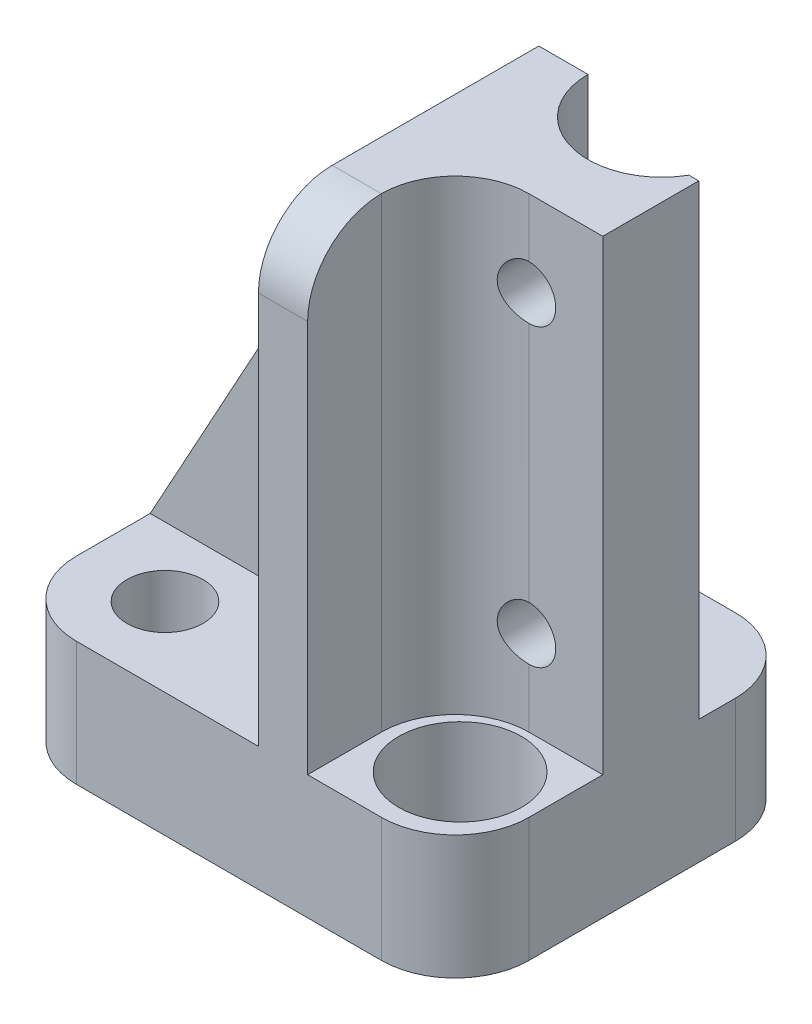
ISO-10303-21;
HEADER;
FILE_DESCRIPTION(('STEP AP214'),'2;1');
FILE_NAME('part.step','',(''),(''),'','','');
FILE_SCHEMA(('AUTOMOTIVE_DESIGN { 1 0 10303 214 1 1 1 1 }'));
ENDSEC;
DATA;
#1=APPLICATION_CONTEXT('core data for automotive mechanical design processes');
#2=APPLICATION_PROTOCOL_DEFINITION('international standard','automotive_design',2000,#1);
#3=PRODUCT_CONTEXT('',#1,'mechanical');
#4=PRODUCT('Part','Part','',(#3));
#5=PRODUCT_RELATED_PRODUCT_CATEGORY('part','',(#4));
#6=PRODUCT_DEFINITION_FORMATION('','',#4);
#7=PRODUCT_DEFINITION_CONTEXT('part definition',#1,'design');
#8=PRODUCT_DEFINITION('design','',#6,#7);
#9=PRODUCT_DEFINITION_SHAPE('','',#8);
#10=(LENGTH_UNIT() NAMED_UNIT(*) SI_UNIT(.MILLI.,.METRE.));
#11=(NAMED_UNIT(*) PLANE_ANGLE_UNIT() SI_UNIT($,.RADIAN.));
#12=(NAMED_UNIT(*) SI_UNIT($,.STERADIAN.) SOLID_ANGLE_UNIT());
#13=UNCERTAINTY_MEASURE_WITH_UNIT(LENGTH_MEASURE(1.E-05),#10,'distance_accuracy_value','');
#14=(GEOMETRIC_REPRESENTATION_CONTEXT(3) GLOBAL_UNCERTAINTY_ASSIGNED_CONTEXT((#13)) GLOBAL_UNIT_ASSIGNED_CONTEXT((#10,
#11,#12)) REPRESENTATION_CONTEXT('',''));
#15=CARTESIAN_POINT('',(0.,0.,0.));
#16=DIRECTION('',(0.,0.,1.));
#17=DIRECTION('',(1.,0.,0.));
#18=AXIS2_PLACEMENT_3D('',#15,#16,#17);
#19=CARTESIAN_POINT('',(4.7625,0.,19.685));
#20=DIRECTION('',(-1.,0.,0.));
#21=DIRECTION('',(0.,0.,1.));
#22=AXIS2_PLACEMENT_3D('',#19,#20,#21);
#23=PLANE('',#22);
#24=DIRECTION('',(0.,0.,-1.));
#25=VECTOR('',#24,1.);
#26=CARTESIAN_POINT('',(4.7625,8.001,19.685));
#27=LINE('',#26,#25);
#28=CARTESIAN_POINT('',(4.7625,8.001,13.335));
#29=VERTEX_POINT('',#28);
#30=CARTESIAN_POINT('',(4.7625,8.001,8.5725));
#31=VERTEX_POINT('',#30);
#32=EDGE_CURVE('E434',#29,#31,#27,.T.);
#33=ORIENTED_EDGE('',*,*,#32,.F.);
#34=DIRECTION('',(0.,1.,0.));
#35=VECTOR('',#34,1.);
#36=CARTESIAN_POINT('',(4.7625,0.,13.335));
#37=LINE('',#36,#35);
#38=CARTESIAN_POINT('',(4.7625,0.,13.335));
#39=VERTEX_POINT('',#38);
#40=EDGE_CURVE('E343',#29,#39,#37,.F.);
#41=ORIENTED_EDGE('',*,*,#40,.T.);
#42=DIRECTION('',(0.,0.,-1.));
#43=VECTOR('',#42,1.);
#44=CARTESIAN_POINT('',(4.7625,0.,19.685));
#45=LINE('',#44,#43);
#46=CARTESIAN_POINT('',(4.7625,0.,0.));
#47=VERTEX_POINT('',#46);
#48=EDGE_CURVE('E408',#39,#47,#45,.T.);
#49=ORIENTED_EDGE('',*,*,#48,.T.);
#50=DIRECTION('',(0.,1.,0.));
#51=VECTOR('',#50,1.);
#52=CARTESIAN_POINT('',(4.7625,0.,0.));
#53=LINE('',#52,#51);
#54=CARTESIAN_POINT('',(4.7625,8.001,0.));
#55=VERTEX_POINT('',#54);
#56=EDGE_CURVE('E455',#47,#55,#53,.T.);
#57=ORIENTED_EDGE('',*,*,#56,.T.);
#58=DIRECTION('',(0.,0.,-1.));
#59=VECTOR('',#58,1.);
#60=CARTESIAN_POINT('',(4.7625,8.001,-19.685));
#61=LINE('',#60,#59);
#62=CARTESIAN_POINT('',(4.7625,8.001,2.37595244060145));
#63=VERTEX_POINT('',#62);
#64=EDGE_CURVE('E475',#63,#55,#61,.T.);
#65=ORIENTED_EDGE('',*,*,#64,.F.);
#66=DIRECTION('',(0.,1.,0.));
#67=VECTOR('',#66,1.);
#68=CARTESIAN_POINT('',(4.7625,8.001,2.37595244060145));
#69=LINE('',#68,#67);
#70=CARTESIAN_POINT('',(4.7625,38.1,2.37595244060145));
#71=VERTEX_POINT('',#70);
#72=EDGE_CURVE('E491',#63,#71,#69,.T.);
#73=ORIENTED_EDGE('',*,*,#72,.T.);
#74=DIRECTION('',(0.,0.,-1.));
#75=VECTOR('',#74,1.);
#76=CARTESIAN_POINT('',(4.7625,38.1,19.685));
#77=LINE('',#76,#75);
#78=CARTESIAN_POINT('',(4.7625,38.1,8.5725));
#79=VERTEX_POINT('',#78);
#80=EDGE_CURVE('E379',#79,#71,#77,.T.);
#81=ORIENTED_EDGE('',*,*,#80,.F.);
#82=DIRECTION('',(0.,1.,0.));
#83=VECTOR('',#82,1.);
#84=CARTESIAN_POINT('',(4.7625,8.001,8.5725));
#85=LINE('',#84,#83);
#86=EDGE_CURVE('E447',#31,#79,#85,.T.);
#87=ORIENTED_EDGE('',*,*,#86,.F.);
#88=EDGE_LOOP('',(#33,#41,#49,#57,#65,#73,#81,#87));
#89=FACE_BOUND('',#88,.T.);
#90=ADVANCED_FACE('F37',(#89),#23,.F.);
#91=CARTESIAN_POINT('',(-24.4475,8.001,19.685));
#92=DIRECTION('',(1.,0.,0.));
#93=DIRECTION('',(0.,0.,-1.));
#94=AXIS2_PLACEMENT_3D('',#91,#92,#93);
#95=PLANE('',#94);
#96=DIRECTION('',(0.,0.,-1.));
#97=VECTOR('',#96,1.);
#98=CARTESIAN_POINT('',(-24.4475,0.,19.685));
#99=LINE('',#98,#97);
#100=CARTESIAN_POINT('',(-24.4475,0.,13.335));
#101=VERTEX_POINT('',#100);
#102=CARTESIAN_POINT('',(-24.4475,0.,6.03250000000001));
#103=VERTEX_POINT('',#102);
#104=EDGE_CURVE('E410',#101,#103,#99,.T.);
#105=ORIENTED_EDGE('',*,*,#104,.F.);
#106=DIRECTION('',(0.,1.,0.));
#107=VECTOR('',#106,1.);
#108=CARTESIAN_POINT('',(-24.4475,8.001,13.335));
#109=LINE('',#108,#107);
#110=CARTESIAN_POINT('',(-24.4475,8.001,13.335));
#111=VERTEX_POINT('',#110);
#112=EDGE_CURVE('E335',#101,#111,#109,.T.);
#113=ORIENTED_EDGE('',*,*,#112,.T.);
#114=DIRECTION('',(0.,0.,-1.));
#115=VECTOR('',#114,1.);
#116=CARTESIAN_POINT('',(-24.4475,8.001,19.685));
#117=LINE('',#116,#115);
#118=CARTESIAN_POINT('',(-24.4475,8.001,8.5725));
#119=VERTEX_POINT('',#118);
#120=EDGE_CURVE('E380',#111,#119,#117,.T.);
#121=ORIENTED_EDGE('',*,*,#120,.T.);
#122=CARTESIAN_POINT('',(-24.4475,8.001,6.03250000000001));
#123=VERTEX_POINT('',#122);
#124=EDGE_CURVE('E398',#119,#123,#117,.T.);
#125=ORIENTED_EDGE('',*,*,#124,.T.);
#126=DIRECTION('',(0.,1.,0.));
#127=VECTOR('',#126,1.);
#128=CARTESIAN_POINT('',(-24.4475,0.,6.03250000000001));
#129=LINE('',#128,#127);
#130=EDGE_CURVE('E461',#103,#123,#129,.T.);
#131=ORIENTED_EDGE('',*,*,#130,.F.);
#132=EDGE_LOOP('',(#105,#113,#121,#125,#131));
#133=FACE_BOUND('',#132,.T.);
#134=ADVANCED_FACE('F302',(#133),#95,.F.);
#135=CARTESIAN_POINT('',(-24.4475,0.,19.685));
#136=DIRECTION('',(0.,1.,0.));
#137=DIRECTION('',(0.,0.,1.));
#138=AXIS2_PLACEMENT_3D('',#135,#136,#137);
#139=PLANE('',#138);
#140=CARTESIAN_POINT('',(-19.05,0.,13.0175));
#141=DIRECTION('',(0.,1.,0.));
#142=DIRECTION('',(0.,0.,1.));
#143=AXIS2_PLACEMENT_3D('',#140,#141,#142);
#144=CIRCLE('',#143,2.45745);
#145=CARTESIAN_POINT('',(-19.05,0.,15.47495));
#146=VERTEX_POINT('',#145);
#147=EDGE_CURVE('E537',#146,#146,#144,.T.);
#148=ORIENTED_EDGE('',*,*,#147,.T.);
#149=EDGE_LOOP('',(#148));
#150=FACE_BOUND('',#149,.T.);
#151=CARTESIAN_POINT('',(0.,0.,13.0175));
#152=DIRECTION('',(0.,1.,0.));
#153=DIRECTION('',(0.,0.,1.));
#154=AXIS2_PLACEMENT_3D('',#151,#152,#153);
#155=CIRCLE('',#154,2.45745);
#156=CARTESIAN_POINT('',(0.,0.,15.47495));
#157=VERTEX_POINT('',#156);
#158=EDGE_CURVE('E534',#157,#157,#155,.T.);
#159=ORIENTED_EDGE('',*,*,#158,.T.);
#160=EDGE_LOOP('',(#159));
#161=FACE_BOUND('',#160,.T.);
#162=ORIENTED_EDGE('',*,*,#48,.F.);
#163=CARTESIAN_POINT('',(0.,0.,13.335));
#164=DIRECTION('',(0.,1.,0.));
#165=DIRECTION('',(0.,0.,1.));
#166=AXIS2_PLACEMENT_3D('',#163,#164,#165);
#167=CIRCLE('',#166,4.7625);
#168=CARTESIAN_POINT('',(0.,0.,18.0975));
#169=VERTEX_POINT('',#168);
#170=EDGE_CURVE('E339',#39,#169,#167,.F.);
#171=ORIENTED_EDGE('',*,*,#170,.T.);
#172=DIRECTION('',(-1.,0.,0.));
#173=VECTOR('',#172,1.);
#174=CARTESIAN_POINT('',(-24.4475,0.,18.0975));
#175=LINE('',#174,#173);
#176=CARTESIAN_POINT('',(-19.685,0.,18.0975));
#177=VERTEX_POINT('',#176);
#178=EDGE_CURVE('E443',#169,#177,#175,.T.);
#179=ORIENTED_EDGE('',*,*,#178,.T.);
#180=CARTESIAN_POINT('',(-19.685,0.,13.335));
#181=DIRECTION('',(0.,1.,0.));
#182=DIRECTION('',(0.,0.,1.));
#183=AXIS2_PLACEMENT_3D('',#180,#181,#182);
#184=CIRCLE('',#183,4.7625);
#185=EDGE_CURVE('E332',#177,#101,#184,.F.);
#186=ORIENTED_EDGE('',*,*,#185,.T.);
#187=ORIENTED_EDGE('',*,*,#104,.T.);
#188=DIRECTION('',(1.,0.,0.));
#189=VECTOR('',#188,1.);
#190=CARTESIAN_POINT('',(-7.9375,0.,6.0325));
#191=LINE('',#190,#189);
#192=CARTESIAN_POINT('',(-12.7,0.,6.0325));
#193=VERTEX_POINT('',#192);
#194=EDGE_CURVE('E522',#103,#193,#191,.T.);
#195=ORIENTED_EDGE('',*,*,#194,.T.);
#196=CARTESIAN_POINT('',(-12.7,0.,1.27));
#197=DIRECTION('',(0.,1.,0.));
#198=DIRECTION('',(0.,0.,1.));
#199=AXIS2_PLACEMENT_3D('',#196,#197,#198);
#200=CIRCLE('',#199,4.7625);
#201=CARTESIAN_POINT('',(-7.9375,0.,1.27));
#202=VERTEX_POINT('',#201);
#203=EDGE_CURVE('E207',#193,#202,#200,.T.);
#204=ORIENTED_EDGE('',*,*,#203,.T.);
#205=DIRECTION('',(0.,0.,-1.));
#206=VECTOR('',#205,1.);
#207=CARTESIAN_POINT('',(-7.9375,0.,-4.7625));
#208=LINE('',#207,#206);
#209=CARTESIAN_POINT('',(-7.9375,0.,0.));
#210=VERTEX_POINT('',#209);
#211=EDGE_CURVE('E517',#202,#210,#208,.T.);
#212=ORIENTED_EDGE('',*,*,#211,.T.);
#213=CARTESIAN_POINT('',(-3.175,0.,0.));
#214=DIRECTION('',(0.,1.,0.));
#215=DIRECTION('',(0.,0.,1.));
#216=AXIS2_PLACEMENT_3D('',#213,#214,#215);
#217=CIRCLE('',#216,4.7625);
#218=CARTESIAN_POINT('',(-3.175,0.,-4.7625));
#219=VERTEX_POINT('',#218);
#220=EDGE_CURVE('E340',#210,#219,#217,.F.);
#221=ORIENTED_EDGE('',*,*,#220,.T.);
#222=DIRECTION('',(1.,0.,0.));
#223=VECTOR('',#222,1.);
#224=CARTESIAN_POINT('',(0.,0.,-4.7625));
#225=LINE('',#224,#223);
#226=CARTESIAN_POINT('',(0.,0.,-4.7625));
#227=VERTEX_POINT('',#226);
#228=EDGE_CURVE('E521',#219,#227,#225,.T.);
#229=ORIENTED_EDGE('',*,*,#228,.T.);
#230=CARTESIAN_POINT('',(0.,0.,0.));
#231=DIRECTION('',(0.,-1.,0.));
#232=DIRECTION('',(0.,0.,1.));
#233=AXIS2_PLACEMENT_3D('',#230,#231,#232);
#234=CIRCLE('',#233,4.7625);
#235=EDGE_CURVE('E439',#227,#47,#234,.T.);
#236=ORIENTED_EDGE('',*,*,#235,.T.);
#237=EDGE_LOOP('',(#162,#171,#179,#186,#187,#195,#204,#212,#221,#229,#236));
#238=FACE_BOUND('',#237,.T.);
#239=ADVANCED_FACE('F308',(#150,#161,#238),#139,.F.);
#240=CARTESIAN_POINT('',(4.7625,38.1,19.685));
#241=DIRECTION('',(0.,-1.,0.));
#242=DIRECTION('',(0.,0.,-1.));
#243=AXIS2_PLACEMENT_3D('',#240,#241,#242);
#244=PLANE('',#243);
#245=DIRECTION('',(0.,0.,-1.));
#246=VECTOR('',#245,1.);
#247=CARTESIAN_POINT('',(-7.9375,38.1,19.685));
#248=LINE('',#247,#246);
#249=CARTESIAN_POINT('',(-7.9375,38.1,13.335));
#250=VERTEX_POINT('',#249);
#251=CARTESIAN_POINT('',(-7.9375,38.1,1.27));
#252=VERTEX_POINT('',#251);
#253=EDGE_CURVE('E374',#250,#252,#248,.T.);
#254=ORIENTED_EDGE('',*,*,#253,.F.);
#255=DIRECTION('',(-1.,0.,0.));
#256=VECTOR('',#255,1.);
#257=CARTESIAN_POINT('',(4.7625,38.1,13.335));
#258=LINE('',#257,#256);
#259=CARTESIAN_POINT('',(-4.7625,38.1,13.335));
#260=VERTEX_POINT('',#259);
#261=EDGE_CURVE('E45',#250,#260,#258,.F.);
#262=ORIENTED_EDGE('',*,*,#261,.T.);
#263=CARTESIAN_POINT('',(0.,38.1,13.335));
#264=DIRECTION('',(0.,-1.,0.));
#265=DIRECTION('',(0.,0.,-1.));
#266=AXIS2_PLACEMENT_3D('',#263,#264,#265);
#267=CIRCLE('',#266,4.7625);
#268=CARTESIAN_POINT('',(0.,38.1,8.5725));
#269=VERTEX_POINT('',#268);
#270=EDGE_CURVE('E244',#260,#269,#267,.T.);
#271=ORIENTED_EDGE('',*,*,#270,.T.);
#272=DIRECTION('',(-1.,0.,0.));
#273=VECTOR('',#272,1.);
#274=CARTESIAN_POINT('',(4.7625,38.1,8.5725));
#275=LINE('',#274,#273);
#276=EDGE_CURVE('E454',#79,#269,#275,.T.);
#277=ORIENTED_EDGE('',*,*,#276,.F.);
#278=ORIENTED_EDGE('',*,*,#80,.T.);
#279=DIRECTION('',(1.,0.,0.));
#280=VECTOR('',#279,1.);
#281=CARTESIAN_POINT('',(4.7625,38.1,2.37595244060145));
#282=LINE('',#281,#280);
#283=CARTESIAN_POINT('',(4.1275,38.1,2.37595244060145));
#284=VERTEX_POINT('',#283);
#285=EDGE_CURVE('E483',#284,#71,#282,.T.);
#286=ORIENTED_EDGE('',*,*,#285,.F.);
#287=CARTESIAN_POINT('',(0.,38.1,0.));
#288=DIRECTION('',(0.,1.,0.));
#289=DIRECTION('',(0.,0.,1.));
#290=AXIS2_PLACEMENT_3D('',#287,#288,#289);
#291=CIRCLE('',#290,4.7625);
#292=CARTESIAN_POINT('',(-4.7625,38.1,0.));
#293=VERTEX_POINT('',#292);
#294=EDGE_CURVE('E450',#293,#284,#291,.T.);
#295=ORIENTED_EDGE('',*,*,#294,.F.);
#296=DIRECTION('',(1.,0.,0.));
#297=VECTOR('',#296,1.);
#298=CARTESIAN_POINT('',(-4.7625,38.1,0.));
#299=LINE('',#298,#297);
#300=CARTESIAN_POINT('',(-7.9375,38.1,0.));
#301=VERTEX_POINT('',#300);
#302=EDGE_CURVE('E472',#301,#293,#299,.T.);
#303=ORIENTED_EDGE('',*,*,#302,.F.);
#304=DIRECTION('',(0.,0.,-1.));
#305=VECTOR('',#304,1.);
#306=CARTESIAN_POINT('',(-7.9375,38.1,-4.7625));
#307=LINE('',#306,#305);
#308=EDGE_CURVE('E376',#252,#301,#307,.T.);
#309=ORIENTED_EDGE('',*,*,#308,.F.);
#310=EDGE_LOOP('',(#254,#262,#271,#277,#278,#286,#295,#303,#309));
#311=FACE_BOUND('',#310,.T.);
#312=ADVANCED_FACE('F314',(#311),#244,.F.);
#313=CARTESIAN_POINT('',(-24.4475,8.001,19.685));
#314=DIRECTION('',(0.876762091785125,-0.480924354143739,0.));
#315=DIRECTION('',(0.480924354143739,0.876762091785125,0.));
#316=AXIS2_PLACEMENT_3D('',#313,#314,#315);
#317=PLANE('',#316);
#318=ORIENTED_EDGE('',*,*,#253,.T.);
#319=CARTESIAN_POINT('',(-12.7,29.4175961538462,1.27));
#320=DIRECTION('',(0.876762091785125,-0.480924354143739,0.));
#321=DIRECTION('',(-0.480924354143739,-0.876762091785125,0.));
#322=AXIS2_PLACEMENT_3D('',#319,#320,#321);
#323=ELLIPSE('',#322,9.90280479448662,4.7625);
#324=CARTESIAN_POINT('',(-12.7,29.4175961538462,6.0325));
#325=VERTEX_POINT('',#324);
#326=EDGE_CURVE('E246',#252,#325,#323,.T.);
#327=ORIENTED_EDGE('',*,*,#326,.T.);
#328=DIRECTION('',(-0.480924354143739,-0.876762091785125,0.));
#329=VECTOR('',#328,1.);
#330=CARTESIAN_POINT('',(-24.4475,8.001,6.03250000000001));
#331=LINE('',#330,#329);
#332=EDGE_CURVE('E417',#325,#123,#331,.T.);
#333=ORIENTED_EDGE('',*,*,#332,.T.);
#334=ORIENTED_EDGE('',*,*,#124,.F.);
#335=DIRECTION('',(0.480924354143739,0.876762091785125,0.));
#336=VECTOR('',#335,1.);
#337=CARTESIAN_POINT('',(-24.4475,8.001,8.5725));
#338=LINE('',#337,#336);
#339=CARTESIAN_POINT('',(-12.7,29.4175961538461,8.5725));
#340=VERTEX_POINT('',#339);
#341=EDGE_CURVE('E386',#119,#340,#338,.T.);
#342=ORIENTED_EDGE('',*,*,#341,.T.);
#343=CARTESIAN_POINT('',(-12.7,29.4175961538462,13.335));
#344=DIRECTION('',(0.876762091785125,-0.480924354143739,0.));
#345=DIRECTION('',(-0.480924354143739,-0.876762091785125,0.));
#346=AXIS2_PLACEMENT_3D('',#343,#344,#345);
#347=ELLIPSE('',#346,9.90280479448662,4.7625);
#348=EDGE_CURVE('E241',#340,#250,#347,.T.);
#349=ORIENTED_EDGE('',*,*,#348,.T.);
#350=EDGE_LOOP('',(#318,#327,#333,#334,#342,#349));
#351=FACE_BOUND('',#350,.T.);
#352=ADVANCED_FACE('F383',(#351),#317,.F.);
#353=CARTESIAN_POINT('',(0.,8.001,0.));
#354=DIRECTION('',(0.,1.,0.));
#355=DIRECTION('',(0.,0.,1.));
#356=AXIS2_PLACEMENT_3D('',#353,#354,#355);
#357=CYLINDRICAL_SURFACE('',#356,4.7625);
#358=CARTESIAN_POINT('',(1.7272,32.5755,4.43826389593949));
#359=CARTESIAN_POINT('',(1.7272024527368,32.6690250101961,4.43826170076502));
#360=CARTESIAN_POINT('',(1.71957825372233,32.7625332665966,4.44125227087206));
#361=CARTESIAN_POINT('',(1.68941050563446,32.9467453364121,4.45281432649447));
#362=CARTESIAN_POINT('',(1.66686659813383,33.0374490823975,4.46138594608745));
#363=CARTESIAN_POINT('',(1.60778321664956,33.2133454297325,4.48301418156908));
#364=CARTESIAN_POINT('',(1.57127535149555,33.2985499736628,4.49606066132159));
#365=CARTESIAN_POINT('',(1.48541126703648,33.4616567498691,4.5251527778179));
#366=CARTESIAN_POINT('',(1.43605147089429,33.5395569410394,4.54119924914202));
#367=CARTESIAN_POINT('',(1.32342999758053,33.6894604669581,4.57531830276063));
#368=CARTESIAN_POINT('',(1.25966957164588,33.7610762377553,4.59344781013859));
#369=CARTESIAN_POINT('',(1.12111687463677,33.8928690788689,4.6292134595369));
#370=CARTESIAN_POINT('',(1.04632244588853,33.9530439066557,4.64684950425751));
#371=CARTESIAN_POINT('',(0.884916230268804,34.0620799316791,4.68031233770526));
#372=CARTESIAN_POINT('',(0.798006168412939,34.1105245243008,4.6960645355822));
#373=CARTESIAN_POINT('',(0.616598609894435,34.1919469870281,4.723304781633));
#374=CARTESIAN_POINT('',(0.522103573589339,34.2249298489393,4.73479420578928));
#375=CARTESIAN_POINT('',(0.332279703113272,34.2731472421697,4.75181055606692));
#376=CARTESIAN_POINT('',(0.237140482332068,34.289047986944,4.75756062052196));
#377=CARTESIAN_POINT('',(0.0453819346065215,34.3047794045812,4.7632484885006));
#378=CARTESIAN_POINT('',(-0.0512369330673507,34.3046149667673,4.76318806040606));
#379=CARTESIAN_POINT('',(-0.238455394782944,34.288619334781,4.75740656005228));
#380=CARTESIAN_POINT('',(-0.32912650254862,34.2735141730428,4.7519478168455));
#381=CARTESIAN_POINT('',(-0.506546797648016,34.2292807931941,4.73632258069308));
#382=CARTESIAN_POINT('',(-0.59329570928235,34.2001515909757,4.72615575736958));
#383=CARTESIAN_POINT('',(-0.761867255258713,34.1283339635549,4.70194903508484));
#384=CARTESIAN_POINT('',(-0.843602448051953,34.0854588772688,4.68785619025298));
#385=CARTESIAN_POINT('',(-0.998915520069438,33.9875279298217,4.65723624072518));
#386=CARTESIAN_POINT('',(-1.07249085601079,33.9324682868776,4.64070838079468));
#387=CARTESIAN_POINT('',(-1.2136878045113,33.8081826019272,4.60586004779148));
#388=CARTESIAN_POINT('',(-1.28075862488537,33.7383435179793,4.58749097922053));
#389=CARTESIAN_POINT('',(-1.40243506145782,33.5882830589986,4.55177029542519));
#390=CARTESIAN_POINT('',(-1.45703795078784,33.5080594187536,4.53441890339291));
#391=CARTESIAN_POINT('',(-1.55318831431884,33.3374672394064,4.50240377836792));
#392=CARTESIAN_POINT('',(-1.59445924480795,33.2469308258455,4.48779931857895));
#393=CARTESIAN_POINT('',(-1.66096705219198,33.0595253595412,4.46361535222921));
#394=CARTESIAN_POINT('',(-1.68621216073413,32.9626595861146,4.45403326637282));
#395=CARTESIAN_POINT('',(-1.71873956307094,32.7707579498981,4.44157966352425));
#396=CARTESIAN_POINT('',(-1.72689070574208,32.675890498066,4.43838397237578));
#397=CARTESIAN_POINT('',(-1.72749177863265,32.4861101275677,4.43815063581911));
#398=CARTESIAN_POINT('',(-1.71994527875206,32.3911972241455,4.44111159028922));
#399=CARTESIAN_POINT('',(-1.69015114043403,32.208315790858,4.45253046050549));
#400=CARTESIAN_POINT('',(-1.66855346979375,32.1202244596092,4.46074508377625));
#401=CARTESIAN_POINT('',(-1.61207609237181,31.9489488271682,4.48146351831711));
#402=CARTESIAN_POINT('',(-1.5771937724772,31.8657654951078,4.49396817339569));
#403=CARTESIAN_POINT('',(-1.49372582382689,31.7033550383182,4.52241023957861));
#404=CARTESIAN_POINT('',(-1.44469384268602,31.6243765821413,4.53845462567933));
#405=CARTESIAN_POINT('',(-1.33480249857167,31.4754580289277,4.57198033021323));
#406=CARTESIAN_POINT('',(-1.2739390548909,31.4055210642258,4.58946214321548));
#407=CARTESIAN_POINT('',(-1.13788812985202,31.2724245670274,4.62513115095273));
#408=CARTESIAN_POINT('',(-1.06207032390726,31.2099022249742,4.6432996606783));
#409=CARTESIAN_POINT('',(-0.900571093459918,31.0984022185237,4.6773045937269));
#410=CARTESIAN_POINT('',(-0.814889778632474,31.0494244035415,4.69314104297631));
#411=CARTESIAN_POINT('',(-0.636285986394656,30.9667759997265,4.72066340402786));
#412=CARTESIAN_POINT('',(-0.543399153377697,30.9330350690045,4.73236833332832));
#413=CARTESIAN_POINT('',(-0.35275097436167,30.881830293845,4.75038126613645));
#414=CARTESIAN_POINT('',(-0.254991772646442,30.8643593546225,4.75669162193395));
#415=CARTESIAN_POINT('',(-0.0631529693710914,30.8469179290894,4.76299521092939));
#416=CARTESIAN_POINT('',(0.0308341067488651,30.8460395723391,4.76331614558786));
#417=CARTESIAN_POINT('',(0.217556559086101,30.8595023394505,4.75844456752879));
#418=CARTESIAN_POINT('',(0.310292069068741,30.8738418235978,4.7532526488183));
#419=CARTESIAN_POINT('',(0.489853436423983,30.9167042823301,4.73808000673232));
#420=CARTESIAN_POINT('',(0.576763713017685,30.9449139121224,4.72820524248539));
#421=CARTESIAN_POINT('',(0.744633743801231,31.0144112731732,4.70469111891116));
#422=CARTESIAN_POINT('',(0.825592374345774,31.0557014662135,4.69105105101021));
#423=CARTESIAN_POINT('',(0.982864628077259,31.1521070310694,4.66069310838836));
#424=CARTESIAN_POINT('',(1.05885511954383,31.2077166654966,4.64387256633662));
#425=CARTESIAN_POINT('',(1.20071184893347,31.3303852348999,4.6092340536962));
#426=CARTESIAN_POINT('',(1.26657456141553,31.3974481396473,4.59141573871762));
#427=CARTESIAN_POINT('',(1.38958521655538,31.5449969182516,4.55573955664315));
#428=CARTESIAN_POINT('',(1.44615494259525,31.6259763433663,4.53792175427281));
#429=CARTESIAN_POINT('',(1.5448849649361,31.7968571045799,4.50526934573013));
#430=CARTESIAN_POINT('',(1.58704550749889,31.8867582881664,4.4904346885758));
#431=CARTESIAN_POINT('',(1.65604477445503,32.0746001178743,4.46545673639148));
#432=CARTESIAN_POINT('',(1.68262483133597,32.1726472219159,4.45539314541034));
#433=CARTESIAN_POINT('',(1.7181963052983,32.3723041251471,4.44179970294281));
#434=CARTESIAN_POINT('',(1.72719733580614,32.4739119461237,4.43826628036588));
#435=CARTESIAN_POINT('',(1.7272,32.5755,4.43826389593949));
#436=B_SPLINE_CURVE_WITH_KNOTS('',3,(#358,#359,#360,#361,#362,#363,#364,#365,#366,#367,#368,
#369,#370,#371,#372,#373,#374,#375,#376,#377,#378,#379,#380,#381,#382,#383,#384,#385,#386,#387,
#388,#389,#390,#391,#392,#393,#394,#395,#396,#397,#398,#399,#400,#401,#402,#403,#404,#405,#406,
#407,#408,#409,#410,#411,#412,#413,#414,#415,#416,#417,#418,#419,#420,#421,#422,#423,#424,#425,
#426,#427,#428,#429,#430,#431,#432,#433,#434,#435),.UNSPECIFIED.,.T.,.F.,(4,2,2,2,2,2,2,2,2,2,2,
2,2,2,2,2,2,2,2,2,2,2,2,2,2,2,2,2,2,2,2,2,2,2,2,2,2,2,4),(0.,0.280197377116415,
0.560401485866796,0.839975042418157,1.11962649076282,1.41107897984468,1.7025885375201,
2.00329061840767,2.30389555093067,2.59229594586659,2.88060856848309,3.15556663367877,
3.43054399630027,3.70942590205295,3.98839448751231,4.28272167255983,4.57711316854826,
4.87726856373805,5.17726965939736,5.46161111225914,5.74588790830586,6.01786922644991,
6.28990407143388,6.57168943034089,6.85357215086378,7.15197079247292,7.4503661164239,
7.74736943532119,8.04424318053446,8.32482325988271,8.60537310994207,8.87985756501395,
9.15439370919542,9.44010280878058,9.72591113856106,10.0255929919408,10.3252697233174,
10.6297902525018,10.9341442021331),.UNSPECIFIED.);
#437=CARTESIAN_POINT('',(1.7272,32.5755,4.43826389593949));
#438=VERTEX_POINT('',#437);
#439=EDGE_CURVE('E216',#438,#438,#436,.T.);
#440=ORIENTED_EDGE('',*,*,#439,.T.);
#441=EDGE_LOOP('',(#440));
#442=FACE_BOUND('',#441,.T.);
#443=CARTESIAN_POINT('',(1.7272,13.5255,4.43826389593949));
#444=CARTESIAN_POINT('',(1.7272024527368,13.6190250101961,4.43826170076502));
#445=CARTESIAN_POINT('',(1.71957825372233,13.7125332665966,4.44125227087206));
#446=CARTESIAN_POINT('',(1.68941050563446,13.8967453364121,4.45281432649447));
#447=CARTESIAN_POINT('',(1.66686659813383,13.9874490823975,4.46138594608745));
#448=CARTESIAN_POINT('',(1.60778321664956,14.1633454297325,4.48301418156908));
#449=CARTESIAN_POINT('',(1.57127535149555,14.2485499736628,4.49606066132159));
#450=CARTESIAN_POINT('',(1.48541126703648,14.4116567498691,4.5251527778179));
#451=CARTESIAN_POINT('',(1.43605147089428,14.4895569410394,4.54119924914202));
#452=CARTESIAN_POINT('',(1.32342999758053,14.6394604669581,4.57531830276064));
#453=CARTESIAN_POINT('',(1.25966957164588,14.7110762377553,4.59344781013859));
#454=CARTESIAN_POINT('',(1.12111687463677,14.8428690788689,4.6292134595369));
#455=CARTESIAN_POINT('',(1.04632244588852,14.9030439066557,4.64684950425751));
#456=CARTESIAN_POINT('',(0.884916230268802,15.0120799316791,4.68031233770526));
#457=CARTESIAN_POINT('',(0.798006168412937,15.0605245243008,4.6960645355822));
#458=CARTESIAN_POINT('',(0.616598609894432,15.1419469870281,4.723304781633));
#459=CARTESIAN_POINT('',(0.522103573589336,15.1749298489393,4.73479420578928));
#460=CARTESIAN_POINT('',(0.332279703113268,15.2231472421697,4.75181055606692));
#461=CARTESIAN_POINT('',(0.237140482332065,15.239047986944,4.75756062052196));
#462=CARTESIAN_POINT('',(0.0453819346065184,15.2547794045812,4.7632484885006));
#463=CARTESIAN_POINT('',(-0.0512369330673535,15.2546149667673,4.76318806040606));
#464=CARTESIAN_POINT('',(-0.238455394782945,15.238619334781,4.75740656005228));
#465=CARTESIAN_POINT('',(-0.329126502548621,15.2235141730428,4.7519478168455));
#466=CARTESIAN_POINT('',(-0.506546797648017,15.1792807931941,4.73632258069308));
#467=CARTESIAN_POINT('',(-0.593295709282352,15.1501515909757,4.72615575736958));
#468=CARTESIAN_POINT('',(-0.761867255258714,15.0783339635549,4.70194903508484));
#469=CARTESIAN_POINT('',(-0.843602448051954,15.0354588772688,4.68785619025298));
#470=CARTESIAN_POINT('',(-0.998915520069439,14.9375279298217,4.65723624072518));
#471=CARTESIAN_POINT('',(-1.07249085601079,14.8824682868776,4.64070838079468));
#472=CARTESIAN_POINT('',(-1.2136878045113,14.7581826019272,4.60586004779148));
#473=CARTESIAN_POINT('',(-1.28075862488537,14.6883435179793,4.58749097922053));
#474=CARTESIAN_POINT('',(-1.40243506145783,14.5382830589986,4.55177029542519));
#475=CARTESIAN_POINT('',(-1.45703795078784,14.4580594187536,4.53441890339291));
#476=CARTESIAN_POINT('',(-1.55318831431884,14.2874672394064,4.50240377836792));
#477=CARTESIAN_POINT('',(-1.59445924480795,14.1969308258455,4.48779931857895));
#478=CARTESIAN_POINT('',(-1.66096705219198,14.0095253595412,4.46361535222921));
#479=CARTESIAN_POINT('',(-1.68621216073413,13.9126595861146,4.45403326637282));
#480=CARTESIAN_POINT('',(-1.71873956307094,13.7207579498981,4.44157966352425));
#481=CARTESIAN_POINT('',(-1.72689070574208,13.625890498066,4.43838397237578));
#482=CARTESIAN_POINT('',(-1.72749177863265,13.4361101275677,4.43815063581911));
#483=CARTESIAN_POINT('',(-1.71994527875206,13.3411972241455,4.44111159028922));
#484=CARTESIAN_POINT('',(-1.69015114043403,13.1583157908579,4.45253046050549));
#485=CARTESIAN_POINT('',(-1.66855346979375,13.0702244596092,4.46074508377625));
#486=CARTESIAN_POINT('',(-1.61207609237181,12.8989488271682,4.48146351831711));
#487=CARTESIAN_POINT('',(-1.5771937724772,12.8157654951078,4.49396817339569));
#488=CARTESIAN_POINT('',(-1.49372582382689,12.6533550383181,4.52241023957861));
#489=CARTESIAN_POINT('',(-1.44469384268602,12.5743765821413,4.53845462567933));
#490=CARTESIAN_POINT('',(-1.33480249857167,12.4254580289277,4.57198033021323));
#491=CARTESIAN_POINT('',(-1.2739390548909,12.3555210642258,4.58946214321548));
#492=CARTESIAN_POINT('',(-1.13788812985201,12.2224245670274,4.62513115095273));
#493=CARTESIAN_POINT('',(-1.06207032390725,12.1599022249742,4.6432996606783));
#494=CARTESIAN_POINT('',(-0.900571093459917,12.0484022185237,4.6773045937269));
#495=CARTESIAN_POINT('',(-0.814889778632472,11.9994244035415,4.69314104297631));
#496=CARTESIAN_POINT('',(-0.636285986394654,11.9167759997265,4.72066340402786));
#497=CARTESIAN_POINT('',(-0.543399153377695,11.8830350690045,4.73236833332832));
#498=CARTESIAN_POINT('',(-0.352750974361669,11.831830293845,4.75038126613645));
#499=CARTESIAN_POINT('',(-0.254991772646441,11.8143593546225,4.75669162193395));
#500=CARTESIAN_POINT('',(-0.0631529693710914,11.7969179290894,4.76299521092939));
#501=CARTESIAN_POINT('',(0.0308341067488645,11.7960395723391,4.76331614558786));
#502=CARTESIAN_POINT('',(0.217556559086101,11.8095023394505,4.75844456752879));
#503=CARTESIAN_POINT('',(0.310292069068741,11.8238418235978,4.7532526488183));
#504=CARTESIAN_POINT('',(0.489853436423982,11.8667042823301,4.73808000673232));
#505=CARTESIAN_POINT('',(0.576763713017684,11.8949139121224,4.72820524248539));
#506=CARTESIAN_POINT('',(0.74463374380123,11.9644112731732,4.70469111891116));
#507=CARTESIAN_POINT('',(0.825592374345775,12.0057014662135,4.69105105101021));
#508=CARTESIAN_POINT('',(0.982864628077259,12.1021070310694,4.66069310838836));
#509=CARTESIAN_POINT('',(1.05885511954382,12.1577166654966,4.64387256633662));
#510=CARTESIAN_POINT('',(1.20071184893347,12.2803852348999,4.6092340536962));
#511=CARTESIAN_POINT('',(1.26657456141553,12.3474481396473,4.59141573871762));
#512=CARTESIAN_POINT('',(1.38958521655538,12.4949969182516,4.55573955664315));
#513=CARTESIAN_POINT('',(1.44615494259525,12.5759763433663,4.53792175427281));
#514=CARTESIAN_POINT('',(1.5448849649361,12.7468571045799,4.50526934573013));
#515=CARTESIAN_POINT('',(1.58704550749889,12.8367582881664,4.4904346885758));
#516=CARTESIAN_POINT('',(1.65604477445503,13.0246001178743,4.46545673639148));
#517=CARTESIAN_POINT('',(1.68262483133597,13.1226472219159,4.45539314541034));
#518=CARTESIAN_POINT('',(1.7181963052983,13.3223041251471,4.44179970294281));
#519=CARTESIAN_POINT('',(1.72719733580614,13.4239119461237,4.43826628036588));
#520=CARTESIAN_POINT('',(1.7272,13.5255,4.43826389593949));
#521=B_SPLINE_CURVE_WITH_KNOTS('',3,(#443,#444,#445,#446,#447,#448,#449,#450,#451,#452,#453,
#454,#455,#456,#457,#458,#459,#460,#461,#462,#463,#464,#465,#466,#467,#468,#469,#470,#471,#472,
#473,#474,#475,#476,#477,#478,#479,#480,#481,#482,#483,#484,#485,#486,#487,#488,#489,#490,#491,
#492,#493,#494,#495,#496,#497,#498,#499,#500,#501,#502,#503,#504,#505,#506,#507,#508,#509,#510,
#511,#512,#513,#514,#515,#516,#517,#518,#519,#520),.UNSPECIFIED.,.T.,.F.,(4,2,2,2,2,2,2,2,2,2,2,
2,2,2,2,2,2,2,2,2,2,2,2,2,2,2,2,2,2,2,2,2,2,2,2,2,2,2,4),(0.,0.280197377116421,
0.560401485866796,0.839975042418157,1.11962649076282,1.41107897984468,1.7025885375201,
2.00329061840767,2.30389555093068,2.59229594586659,2.88060856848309,3.15556663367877,
3.43054399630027,3.70942590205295,3.98839448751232,4.28272167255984,4.57711316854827,
4.87726856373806,5.17726965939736,5.46161111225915,5.74588790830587,6.01786922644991,
6.28990407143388,6.57168943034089,6.85357215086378,7.15197079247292,7.4503661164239,
7.74736943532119,8.04424318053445,8.32482325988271,8.60537310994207,8.87985756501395,
9.15439370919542,9.44010280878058,9.72591113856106,10.0255929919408,10.3252697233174,
10.6297902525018,10.9341442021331),.UNSPECIFIED.);
#522=CARTESIAN_POINT('',(1.7272,13.5255,4.43826389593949));
#523=VERTEX_POINT('',#522);
#524=EDGE_CURVE('E249',#523,#523,#521,.T.);
#525=ORIENTED_EDGE('',*,*,#524,.T.);
#526=EDGE_LOOP('',(#525));
#527=FACE_BOUND('',#526,.T.);
#528=ORIENTED_EDGE('',*,*,#294,.T.);
#529=DIRECTION('',(0.,1.,0.));
#530=VECTOR('',#529,1.);
#531=CARTESIAN_POINT('',(4.1275,8.001,2.37595244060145));
#532=LINE('',#531,#530);
#533=CARTESIAN_POINT('',(4.1275,8.001,2.37595244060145));
#534=VERTEX_POINT('',#533);
#535=EDGE_CURVE('E480',#534,#284,#532,.T.);
#536=ORIENTED_EDGE('',*,*,#535,.F.);
#537=CARTESIAN_POINT('',(0.,8.001,0.));
#538=DIRECTION('',(0.,1.,0.));
#539=DIRECTION('',(0.,0.,1.));
#540=AXIS2_PLACEMENT_3D('',#537,#538,#539);
#541=CIRCLE('',#540,4.7625);
#542=CARTESIAN_POINT('',(-4.7625,8.001,0.));
#543=VERTEX_POINT('',#542);
#544=EDGE_CURVE('E468',#543,#534,#541,.T.);
#545=ORIENTED_EDGE('',*,*,#544,.F.);
#546=DIRECTION('',(0.,1.,0.));
#547=VECTOR('',#546,1.);
#548=CARTESIAN_POINT('',(-4.7625,8.001,0.));
#549=LINE('',#548,#547);
#550=EDGE_CURVE('E402',#543,#293,#549,.T.);
#551=ORIENTED_EDGE('',*,*,#550,.T.);
#552=EDGE_LOOP('',(#528,#536,#545,#551));
#553=FACE_BOUND('',#552,.T.);
#554=ADVANCED_FACE('F261',(#442,#527,#553),#357,.F.);
#555=CARTESIAN_POINT('',(-4.7625,8.001,0.));
#556=DIRECTION('',(0.,0.,1.));
#557=DIRECTION('',(1.,0.,0.));
#558=AXIS2_PLACEMENT_3D('',#555,#556,#557);
#559=PLANE('',#558);
#560=ORIENTED_EDGE('',*,*,#302,.T.);
#561=ORIENTED_EDGE('',*,*,#550,.F.);
#562=DIRECTION('',(1.,0.,0.));
#563=VECTOR('',#562,1.);
#564=CARTESIAN_POINT('',(-4.7625,8.001,0.));
#565=LINE('',#564,#563);
#566=CARTESIAN_POINT('',(-7.9375,8.001,0.));
#567=VERTEX_POINT('',#566);
#568=EDGE_CURVE('E477',#567,#543,#565,.T.);
#569=ORIENTED_EDGE('',*,*,#568,.F.);
#570=DIRECTION('',(0.,1.,0.));
#571=VECTOR('',#570,1.);
#572=CARTESIAN_POINT('',(-7.9375,8.001,0.));
#573=LINE('',#572,#571);
#574=EDGE_CURVE('E488',#567,#301,#573,.T.);
#575=ORIENTED_EDGE('',*,*,#574,.T.);
#576=EDGE_LOOP('',(#560,#561,#569,#575));
#577=FACE_BOUND('',#576,.T.);
#578=ADVANCED_FACE('F510',(#577),#559,.F.);
#579=CARTESIAN_POINT('',(4.7625,8.001,2.37595244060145));
#580=DIRECTION('',(0.,0.,1.));
#581=DIRECTION('',(1.,0.,0.));
#582=AXIS2_PLACEMENT_3D('',#579,#580,#581);
#583=PLANE('',#582);
#584=ORIENTED_EDGE('',*,*,#285,.T.);
#585=ORIENTED_EDGE('',*,*,#72,.F.);
#586=DIRECTION('',(1.,0.,0.));
#587=VECTOR('',#586,1.);
#588=CARTESIAN_POINT('',(4.7625,8.001,2.37595244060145));
#589=LINE('',#588,#587);
#590=EDGE_CURVE('E471',#534,#63,#589,.T.);
#591=ORIENTED_EDGE('',*,*,#590,.F.);
#592=ORIENTED_EDGE('',*,*,#535,.T.);
#593=EDGE_LOOP('',(#584,#585,#591,#592));
#594=FACE_BOUND('',#593,.T.);
#595=ADVANCED_FACE('F496',(#594),#583,.F.);
#596=CARTESIAN_POINT('',(0.,8.001,0.));
#597=DIRECTION('',(0.,1.,0.));
#598=DIRECTION('',(0.,0.,1.));
#599=AXIS2_PLACEMENT_3D('',#596,#597,#598);
#600=PLANE('',#599);
#601=DIRECTION('',(1.,0.,0.));
#602=VECTOR('',#601,1.);
#603=CARTESIAN_POINT('',(0.,8.001,-4.7625));
#604=LINE('',#603,#602);
#605=CARTESIAN_POINT('',(-3.175,8.001,-4.7625));
#606=VERTEX_POINT('',#605);
#607=CARTESIAN_POINT('',(0.,8.001,-4.7625));
#608=VERTEX_POINT('',#607);
#609=EDGE_CURVE('E413',#606,#608,#604,.T.);
#610=ORIENTED_EDGE('',*,*,#609,.F.);
#611=CARTESIAN_POINT('',(-3.175,8.001,0.));
#612=DIRECTION('',(0.,1.,0.));
#613=DIRECTION('',(0.,0.,1.));
#614=AXIS2_PLACEMENT_3D('',#611,#612,#613);
#615=CIRCLE('',#614,4.7625);
#616=EDGE_CURVE('E232',#606,#567,#615,.T.);
#617=ORIENTED_EDGE('',*,*,#616,.T.);
#618=ORIENTED_EDGE('',*,*,#568,.T.);
#619=ORIENTED_EDGE('',*,*,#544,.T.);
#620=ORIENTED_EDGE('',*,*,#590,.T.);
#621=ORIENTED_EDGE('',*,*,#64,.T.);
#622=CARTESIAN_POINT('',(0.,8.001,0.));
#623=DIRECTION('',(0.,1.,0.));
#624=DIRECTION('',(0.,0.,1.));
#625=AXIS2_PLACEMENT_3D('',#622,#623,#624);
#626=CIRCLE('',#625,4.7625);
#627=EDGE_CURVE('E415',#608,#55,#626,.F.);
#628=ORIENTED_EDGE('',*,*,#627,.F.);
#629=EDGE_LOOP('',(#610,#617,#618,#619,#620,#621,#628));
#630=FACE_BOUND('',#629,.T.);
#631=ADVANCED_FACE('F504',(#630),#600,.T.);
#632=CARTESIAN_POINT('',(-24.4475,8.001,8.5725));
#633=DIRECTION('',(0.,0.,-1.));
#634=DIRECTION('',(-1.,0.,0.));
#635=AXIS2_PLACEMENT_3D('',#632,#633,#634);
#636=PLANE('',#635);
#637=DIRECTION('',(-1.,0.,0.));
#638=VECTOR('',#637,1.);
#639=CARTESIAN_POINT('',(-24.4475,8.001,8.5725));
#640=LINE('',#639,#638);
#641=CARTESIAN_POINT('',(-12.7,8.001,8.5725));
#642=VERTEX_POINT('',#641);
#643=EDGE_CURVE('E393',#642,#119,#640,.T.);
#644=ORIENTED_EDGE('',*,*,#643,.F.);
#645=DIRECTION('',(0.,1.,0.));
#646=VECTOR('',#645,1.);
#647=CARTESIAN_POINT('',(-12.7,38.1,8.5725));
#648=LINE('',#647,#646);
#649=EDGE_CURVE('E352',#642,#340,#648,.T.);
#650=ORIENTED_EDGE('',*,*,#649,.T.);
#651=ORIENTED_EDGE('',*,*,#341,.F.);
#652=EDGE_LOOP('',(#644,#650,#651));
#653=FACE_BOUND('',#652,.T.);
#654=ADVANCED_FACE('F397',(#653),#636,.F.);
#655=CARTESIAN_POINT('',(-7.9375,8.001,19.685));
#656=DIRECTION('',(1.,0.,0.));
#657=DIRECTION('',(0.,0.,-1.));
#658=AXIS2_PLACEMENT_3D('',#655,#656,#657);
#659=PLANE('',#658);
#660=DIRECTION('',(0.,1.,0.));
#661=VECTOR('',#660,1.);
#662=CARTESIAN_POINT('',(-7.9375,8.001,18.0975));
#663=LINE('',#662,#661);
#664=CARTESIAN_POINT('',(-7.9375,8.001,18.0975));
#665=VERTEX_POINT('',#664);
#666=CARTESIAN_POINT('',(-7.9375,33.3375,18.0975));
#667=VERTEX_POINT('',#666);
#668=EDGE_CURVE('E527',#665,#667,#663,.T.);
#669=ORIENTED_EDGE('',*,*,#668,.T.);
#670=CARTESIAN_POINT('',(-7.9375,33.3375,13.335));
#671=DIRECTION('',(1.,0.,0.));
#672=DIRECTION('',(0.,0.,-1.));
#673=AXIS2_PLACEMENT_3D('',#670,#671,#672);
#674=CIRCLE('',#673,4.7625);
#675=EDGE_CURVE('E52',#667,#250,#674,.F.);
#676=ORIENTED_EDGE('',*,*,#675,.T.);
#677=DIRECTION('',(0.,1.,0.));
#678=VECTOR('',#677,1.);
#679=CARTESIAN_POINT('',(-7.9375,8.001,13.335));
#680=LINE('',#679,#678);
#681=CARTESIAN_POINT('',(-7.9375,8.001,13.335));
#682=VERTEX_POINT('',#681);
#683=EDGE_CURVE('E354',#250,#682,#680,.F.);
#684=ORIENTED_EDGE('',*,*,#683,.T.);
#685=DIRECTION('',(0.,0.,-1.));
#686=VECTOR('',#685,1.);
#687=CARTESIAN_POINT('',(-7.9375,8.001,19.685));
#688=LINE('',#687,#686);
#689=EDGE_CURVE('E395',#665,#682,#688,.T.);
#690=ORIENTED_EDGE('',*,*,#689,.F.);
#691=EDGE_LOOP('',(#669,#676,#684,#690));
#692=FACE_BOUND('',#691,.T.);
#693=ADVANCED_FACE('F547',(#692),#659,.F.);
#694=CARTESIAN_POINT('',(0.,8.001,0.));
#695=DIRECTION('',(0.,-1.,0.));
#696=DIRECTION('',(0.,0.,-1.));
#697=AXIS2_PLACEMENT_3D('',#694,#695,#696);
#698=PLANE('',#697);
#699=CARTESIAN_POINT('',(-19.05,8.001,13.0175));
#700=DIRECTION('',(0.,1.,0.));
#701=DIRECTION('',(0.,0.,1.));
#702=AXIS2_PLACEMENT_3D('',#699,#700,#701);
#703=CIRCLE('',#702,2.45745);
#704=CARTESIAN_POINT('',(-19.05,8.001,15.47495));
#705=VERTEX_POINT('',#704);
#706=EDGE_CURVE('E539',#705,#705,#703,.T.);
#707=ORIENTED_EDGE('',*,*,#706,.F.);
#708=EDGE_LOOP('',(#707));
#709=FACE_BOUND('',#708,.T.);
#710=ORIENTED_EDGE('',*,*,#120,.F.);
#711=CARTESIAN_POINT('',(-19.685,8.001,13.335));
#712=DIRECTION('',(0.,-1.,0.));
#713=DIRECTION('',(0.,0.,-1.));
#714=AXIS2_PLACEMENT_3D('',#711,#712,#713);
#715=CIRCLE('',#714,4.7625);
#716=CARTESIAN_POINT('',(-19.685,8.001,18.0975));
#717=VERTEX_POINT('',#716);
#718=EDGE_CURVE('E350',#111,#717,#715,.F.);
#719=ORIENTED_EDGE('',*,*,#718,.T.);
#720=DIRECTION('',(1.,0.,0.));
#721=VECTOR('',#720,1.);
#722=CARTESIAN_POINT('',(0.,8.001,18.0975));
#723=LINE('',#722,#721);
#724=EDGE_CURVE('E529',#717,#665,#723,.T.);
#725=ORIENTED_EDGE('',*,*,#724,.T.);
#726=ORIENTED_EDGE('',*,*,#689,.T.);
#727=CARTESIAN_POINT('',(-12.7,8.001,13.335));
#728=DIRECTION('',(0.,-1.,0.));
#729=DIRECTION('',(0.,0.,-1.));
#730=AXIS2_PLACEMENT_3D('',#727,#728,#729);
#731=CIRCLE('',#730,4.7625);
#732=EDGE_CURVE('E348',#682,#642,#731,.F.);
#733=ORIENTED_EDGE('',*,*,#732,.T.);
#734=ORIENTED_EDGE('',*,*,#643,.T.);
#735=EDGE_LOOP('',(#710,#719,#725,#726,#733,#734));
#736=FACE_BOUND('',#735,.T.);
#737=ADVANCED_FACE('F392',(#709,#736),#698,.F.);
#738=CARTESIAN_POINT('',(-4.7625,8.001,19.685));
#739=DIRECTION('',(-1.,0.,0.));
#740=DIRECTION('',(0.,0.,1.));
#741=AXIS2_PLACEMENT_3D('',#738,#739,#740);
#742=PLANE('',#741);
#743=DIRECTION('',(0.,1.,0.));
#744=VECTOR('',#743,1.);
#745=CARTESIAN_POINT('',(-4.7625,38.1,13.335));
#746=LINE('',#745,#744);
#747=CARTESIAN_POINT('',(-4.7625,8.001,13.335));
#748=VERTEX_POINT('',#747);
#749=EDGE_CURVE('E226',#748,#260,#746,.T.);
#750=ORIENTED_EDGE('',*,*,#749,.T.);
#751=CARTESIAN_POINT('',(-4.7625,33.3375,13.335));
#752=DIRECTION('',(-1.,0.,0.));
#753=DIRECTION('',(0.,0.,1.));
#754=AXIS2_PLACEMENT_3D('',#751,#752,#753);
#755=CIRCLE('',#754,4.7625);
#756=CARTESIAN_POINT('',(-4.7625,33.3375,18.0975));
#757=VERTEX_POINT('',#756);
#758=EDGE_CURVE('E11',#260,#757,#755,.F.);
#759=ORIENTED_EDGE('',*,*,#758,.T.);
#760=DIRECTION('',(0.,-1.,0.));
#761=VECTOR('',#760,1.);
#762=CARTESIAN_POINT('',(-4.7625,8.001,18.0975));
#763=LINE('',#762,#761);
#764=CARTESIAN_POINT('',(-4.7625,8.001,18.0975));
#765=VERTEX_POINT('',#764);
#766=EDGE_CURVE('E531',#757,#765,#763,.T.);
#767=ORIENTED_EDGE('',*,*,#766,.T.);
#768=DIRECTION('',(0.,0.,1.));
#769=VECTOR('',#768,1.);
#770=CARTESIAN_POINT('',(-4.7625,8.001,19.685));
#771=LINE('',#770,#769);
#772=EDGE_CURVE('E363',#748,#765,#771,.T.);
#773=ORIENTED_EDGE('',*,*,#772,.F.);
#774=EDGE_LOOP('',(#750,#759,#767,#773));
#775=FACE_BOUND('',#774,.T.);
#776=ADVANCED_FACE('F361',(#775),#742,.F.);
#777=CARTESIAN_POINT('',(4.7625,8.001,8.5725));
#778=DIRECTION('',(0.,0.,-1.));
#779=DIRECTION('',(-1.,0.,0.));
#780=AXIS2_PLACEMENT_3D('',#777,#778,#779);
#781=PLANE('',#780);
#782=DIRECTION('',(0.,1.,0.));
#783=VECTOR('',#782,1.);
#784=CARTESIAN_POINT('',(0.,8.001,8.5725));
#785=LINE('',#784,#783);
#786=CARTESIAN_POINT('',(0.,34.3027,8.5725));
#787=VERTEX_POINT('',#786);
#788=EDGE_CURVE('E215',#269,#787,#785,.F.);
#789=ORIENTED_EDGE('',*,*,#788,.T.);
#790=CARTESIAN_POINT('',(0.,32.5755,8.5725));
#791=DIRECTION('',(0.,0.,-1.));
#792=DIRECTION('',(-1.,0.,0.));
#793=AXIS2_PLACEMENT_3D('',#790,#791,#792);
#794=CIRCLE('',#793,1.7272);
#795=CARTESIAN_POINT('',(0.,30.8483,8.5725));
#796=VERTEX_POINT('',#795);
#797=EDGE_CURVE('E201',#787,#796,#794,.T.);
#798=ORIENTED_EDGE('',*,*,#797,.T.);
#799=CARTESIAN_POINT('',(0.,15.2527,8.5725));
#800=VERTEX_POINT('',#799);
#801=EDGE_CURVE('E212',#796,#800,#785,.F.);
#802=ORIENTED_EDGE('',*,*,#801,.T.);
#803=CARTESIAN_POINT('',(0.,13.5255,8.5725));
#804=DIRECTION('',(0.,0.,-1.));
#805=DIRECTION('',(-1.,0.,0.));
#806=AXIS2_PLACEMENT_3D('',#803,#804,#805);
#807=CIRCLE('',#806,1.7272);
#808=CARTESIAN_POINT('',(0.,11.7983,8.5725));
#809=VERTEX_POINT('',#808);
#810=EDGE_CURVE('E282',#800,#809,#807,.T.);
#811=ORIENTED_EDGE('',*,*,#810,.T.);
#812=CARTESIAN_POINT('',(0.,8.001,8.5725));
#813=VERTEX_POINT('',#812);
#814=EDGE_CURVE('E223',#809,#813,#785,.F.);
#815=ORIENTED_EDGE('',*,*,#814,.T.);
#816=DIRECTION('',(-1.,0.,0.));
#817=VECTOR('',#816,1.);
#818=CARTESIAN_POINT('',(4.7625,8.001,8.5725));
#819=LINE('',#818,#817);
#820=EDGE_CURVE('E448',#31,#813,#819,.T.);
#821=ORIENTED_EDGE('',*,*,#820,.F.);
#822=ORIENTED_EDGE('',*,*,#86,.T.);
#823=ORIENTED_EDGE('',*,*,#276,.T.);
#824=EDGE_LOOP('',(#789,#798,#802,#811,#815,#821,#822,#823));
#825=FACE_BOUND('',#824,.T.);
#826=ADVANCED_FACE('F210',(#825),#781,.F.);
#827=CARTESIAN_POINT('',(0.,8.001,0.));
#828=DIRECTION('',(0.,1.,0.));
#829=DIRECTION('',(0.,0.,1.));
#830=AXIS2_PLACEMENT_3D('',#827,#828,#829);
#831=PLANE('',#830);
#832=CARTESIAN_POINT('',(0.,8.001,13.0175));
#833=DIRECTION('',(0.,1.,0.));
#834=DIRECTION('',(0.,0.,1.));
#835=AXIS2_PLACEMENT_3D('',#832,#833,#834);
#836=CIRCLE('',#835,3.96875);
#837=CARTESIAN_POINT('',(0.,8.001,16.98625));
#838=VERTEX_POINT('',#837);
#839=EDGE_CURVE('E779',#838,#838,#836,.T.);
#840=ORIENTED_EDGE('',*,*,#839,.F.);
#841=EDGE_LOOP('',(#840));
#842=FACE_BOUND('',#841,.T.);
#843=DIRECTION('',(-1.,0.,0.));
#844=VECTOR('',#843,1.);
#845=CARTESIAN_POINT('',(0.,8.001,18.0975));
#846=LINE('',#845,#844);
#847=CARTESIAN_POINT('',(0.,8.001,18.0975));
#848=VERTEX_POINT('',#847);
#849=EDGE_CURVE('E419',#848,#765,#846,.T.);
#850=ORIENTED_EDGE('',*,*,#849,.F.);
#851=CARTESIAN_POINT('',(0.,8.001,13.335));
#852=DIRECTION('',(0.,1.,0.));
#853=DIRECTION('',(0.,0.,1.));
#854=AXIS2_PLACEMENT_3D('',#851,#852,#853);
#855=CIRCLE('',#854,4.7625);
#856=EDGE_CURVE('E428',#848,#29,#855,.T.);
#857=ORIENTED_EDGE('',*,*,#856,.T.);
#858=ORIENTED_EDGE('',*,*,#32,.T.);
#859=ORIENTED_EDGE('',*,*,#820,.T.);
#860=CARTESIAN_POINT('',(0.,8.001,13.335));
#861=DIRECTION('',(0.,1.,0.));
#862=DIRECTION('',(0.,0.,1.));
#863=AXIS2_PLACEMENT_3D('',#860,#861,#862);
#864=CIRCLE('',#863,4.7625);
#865=EDGE_CURVE('E426',#813,#748,#864,.T.);
#866=ORIENTED_EDGE('',*,*,#865,.T.);
#867=ORIENTED_EDGE('',*,*,#772,.T.);
#868=EDGE_LOOP('',(#850,#857,#858,#859,#866,#867));
#869=FACE_BOUND('',#868,.T.);
#870=ADVANCED_FACE('F445',(#842,#869),#831,.T.);
#871=CARTESIAN_POINT('',(-7.9375,0.,6.0325));
#872=DIRECTION('',(0.,0.,1.));
#873=DIRECTION('',(1.,0.,0.));
#874=AXIS2_PLACEMENT_3D('',#871,#872,#873);
#875=PLANE('',#874);
#876=ORIENTED_EDGE('',*,*,#332,.F.);
#877=DIRECTION('',(0.,1.,0.));
#878=VECTOR('',#877,1.);
#879=CARTESIAN_POINT('',(-12.7,0.,6.0325));
#880=LINE('',#879,#878);
#881=EDGE_CURVE('E239',#325,#193,#880,.F.);
#882=ORIENTED_EDGE('',*,*,#881,.T.);
#883=ORIENTED_EDGE('',*,*,#194,.F.);
#884=ORIENTED_EDGE('',*,*,#130,.T.);
#885=EDGE_LOOP('',(#876,#882,#883,#884));
#886=FACE_BOUND('',#885,.T.);
#887=ADVANCED_FACE('F745',(#886),#875,.F.);
#888=CARTESIAN_POINT('',(-7.9375,0.,-4.7625));
#889=DIRECTION('',(1.,0.,0.));
#890=DIRECTION('',(0.,0.,-1.));
#891=AXIS2_PLACEMENT_3D('',#888,#889,#890);
#892=PLANE('',#891);
#893=ORIENTED_EDGE('',*,*,#574,.F.);
#894=DIRECTION('',(0.,1.,0.));
#895=VECTOR('',#894,1.);
#896=CARTESIAN_POINT('',(-7.9375,0.,0.));
#897=LINE('',#896,#895);
#898=EDGE_CURVE('E237',#567,#210,#897,.F.);
#899=ORIENTED_EDGE('',*,*,#898,.T.);
#900=ORIENTED_EDGE('',*,*,#211,.F.);
#901=DIRECTION('',(0.,1.,0.));
#902=VECTOR('',#901,1.);
#903=CARTESIAN_POINT('',(-7.9375,38.1,1.27));
#904=LINE('',#903,#902);
#905=EDGE_CURVE('E234',#202,#252,#904,.T.);
#906=ORIENTED_EDGE('',*,*,#905,.T.);
#907=ORIENTED_EDGE('',*,*,#308,.T.);
#908=EDGE_LOOP('',(#893,#899,#900,#906,#907));
#909=FACE_BOUND('',#908,.T.);
#910=ADVANCED_FACE('F516',(#909),#892,.F.);
#911=CARTESIAN_POINT('',(0.,0.,0.));
#912=DIRECTION('',(0.,1.,0.));
#913=DIRECTION('',(0.,0.,1.));
#914=AXIS2_PLACEMENT_3D('',#911,#912,#913);
#915=CYLINDRICAL_SURFACE('',#914,4.7625);
#916=ORIENTED_EDGE('',*,*,#627,.T.);
#917=ORIENTED_EDGE('',*,*,#56,.F.);
#918=ORIENTED_EDGE('',*,*,#235,.F.);
#919=DIRECTION('',(0.,1.,0.));
#920=VECTOR('',#919,1.);
#921=CARTESIAN_POINT('',(0.,0.,-4.7625));
#922=LINE('',#921,#920);
#923=EDGE_CURVE('E456',#227,#608,#922,.T.);
#924=ORIENTED_EDGE('',*,*,#923,.T.);
#925=EDGE_LOOP('',(#916,#917,#918,#924));
#926=FACE_BOUND('',#925,.T.);
#927=ADVANCED_FACE('F599',(#926),#915,.T.);
#928=CARTESIAN_POINT('',(0.,0.,-4.7625));
#929=DIRECTION('',(0.,0.,1.));
#930=DIRECTION('',(1.,0.,0.));
#931=AXIS2_PLACEMENT_3D('',#928,#929,#930);
#932=PLANE('',#931);
#933=ORIENTED_EDGE('',*,*,#228,.F.);
#934=DIRECTION('',(0.,1.,0.));
#935=VECTOR('',#934,1.);
#936=CARTESIAN_POINT('',(-3.175,0.,-4.7625));
#937=LINE('',#936,#935);
#938=EDGE_CURVE('E225',#219,#606,#937,.T.);
#939=ORIENTED_EDGE('',*,*,#938,.T.);
#940=ORIENTED_EDGE('',*,*,#609,.T.);
#941=ORIENTED_EDGE('',*,*,#923,.F.);
#942=EDGE_LOOP('',(#933,#939,#940,#941));
#943=FACE_BOUND('',#942,.T.);
#944=ADVANCED_FACE('F604',(#943),#932,.F.);
#945=CARTESIAN_POINT('',(-24.4475,0.,18.0975));
#946=DIRECTION('',(0.,0.,-1.));
#947=DIRECTION('',(-1.,0.,0.));
#948=AXIS2_PLACEMENT_3D('',#945,#946,#947);
#949=PLANE('',#948);
#950=ORIENTED_EDGE('',*,*,#766,.F.);
#951=DIRECTION('',(-1.,0.,0.));
#952=VECTOR('',#951,1.);
#953=CARTESIAN_POINT('',(-24.4475,33.3375,18.0975));
#954=LINE('',#953,#952);
#955=EDGE_CURVE('E206',#757,#667,#954,.T.);
#956=ORIENTED_EDGE('',*,*,#955,.T.);
#957=ORIENTED_EDGE('',*,*,#668,.F.);
#958=ORIENTED_EDGE('',*,*,#724,.F.);
#959=DIRECTION('',(0.,1.,0.));
#960=VECTOR('',#959,1.);
#961=CARTESIAN_POINT('',(-19.685,0.,18.0975));
#962=LINE('',#961,#960);
#963=EDGE_CURVE('E333',#717,#177,#962,.F.);
#964=ORIENTED_EDGE('',*,*,#963,.T.);
#965=ORIENTED_EDGE('',*,*,#178,.F.);
#966=DIRECTION('',(0.,1.,0.));
#967=VECTOR('',#966,1.);
#968=CARTESIAN_POINT('',(0.,0.,18.0975));
#969=LINE('',#968,#967);
#970=EDGE_CURVE('E423',#169,#848,#969,.T.);
#971=ORIENTED_EDGE('',*,*,#970,.T.);
#972=ORIENTED_EDGE('',*,*,#849,.T.);
#973=EDGE_LOOP('',(#950,#956,#957,#958,#964,#965,#971,#972));
#974=FACE_BOUND('',#973,.T.);
#975=ADVANCED_FACE('F442',(#974),#949,.F.);
#976=CARTESIAN_POINT('',(0.,8.001,13.0175));
#977=DIRECTION('',(0.,1.,0.));
#978=DIRECTION('',(0.,0.,1.));
#979=AXIS2_PLACEMENT_3D('',#976,#977,#978);
#980=CYLINDRICAL_SURFACE('',#979,2.45745);
#981=CARTESIAN_POINT('',(0.,2.1844,13.0175));
#982=DIRECTION('',(0.,1.,0.));
#983=DIRECTION('',(0.,0.,1.));
#984=AXIS2_PLACEMENT_3D('',#981,#982,#983);
#985=CIRCLE('',#984,2.45745000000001);
#986=CARTESIAN_POINT('',(0.,2.1844,15.47495));
#987=VERTEX_POINT('',#986);
#988=EDGE_CURVE('E217',#987,#987,#985,.T.);
#989=ORIENTED_EDGE('',*,*,#988,.T.);
#990=EDGE_LOOP('',(#989));
#991=FACE_BOUND('',#990,.T.);
#992=ORIENTED_EDGE('',*,*,#158,.F.);
#993=EDGE_LOOP('',(#992));
#994=FACE_BOUND('',#993,.T.);
#995=ADVANCED_FACE('F591',(#991,#994),#980,.F.);
#996=CARTESIAN_POINT('',(-19.05,8.001,13.0175));
#997=DIRECTION('',(0.,1.,0.));
#998=DIRECTION('',(0.,0.,1.));
#999=AXIS2_PLACEMENT_3D('',#996,#997,#998);
#1000=CYLINDRICAL_SURFACE('',#999,2.45745);
#1001=ORIENTED_EDGE('',*,*,#147,.F.);
#1002=EDGE_LOOP('',(#1001));
#1003=FACE_BOUND('',#1002,.T.);
#1004=ORIENTED_EDGE('',*,*,#706,.T.);
#1005=EDGE_LOOP('',(#1004));
#1006=FACE_BOUND('',#1005,.T.);
#1007=ADVANCED_FACE('F273',(#1003,#1006),#1000,.F.);
#1008=CARTESIAN_POINT('',(0.,0.,13.335));
#1009=DIRECTION('',(0.,1.,0.));
#1010=DIRECTION('',(0.,0.,1.));
#1011=AXIS2_PLACEMENT_3D('',#1008,#1009,#1010);
#1012=CYLINDRICAL_SURFACE('',#1011,4.7625);
#1013=ORIENTED_EDGE('',*,*,#170,.F.);
#1014=ORIENTED_EDGE('',*,*,#40,.F.);
#1015=ORIENTED_EDGE('',*,*,#856,.F.);
#1016=ORIENTED_EDGE('',*,*,#970,.F.);
#1017=EDGE_LOOP('',(#1013,#1014,#1015,#1016));
#1018=FACE_BOUND('',#1017,.T.);
#1019=ADVANCED_FACE('F319',(#1018),#1012,.T.);
#1020=CARTESIAN_POINT('',(-19.685,8.001,13.335));
#1021=DIRECTION('',(0.,1.,0.));
#1022=DIRECTION('',(0.,0.,1.));
#1023=AXIS2_PLACEMENT_3D('',#1020,#1021,#1022);
#1024=CYLINDRICAL_SURFACE('',#1023,4.7625);
#1025=ORIENTED_EDGE('',*,*,#185,.F.);
#1026=ORIENTED_EDGE('',*,*,#963,.F.);
#1027=ORIENTED_EDGE('',*,*,#718,.F.);
#1028=ORIENTED_EDGE('',*,*,#112,.F.);
#1029=EDGE_LOOP('',(#1025,#1026,#1027,#1028));
#1030=FACE_BOUND('',#1029,.T.);
#1031=ADVANCED_FACE('F321',(#1030),#1024,.T.);
#1032=CARTESIAN_POINT('',(-12.7,8.001,13.335));
#1033=DIRECTION('',(0.,-1.,0.));
#1034=DIRECTION('',(0.,0.,-1.));
#1035=AXIS2_PLACEMENT_3D('',#1032,#1033,#1034);
#1036=CYLINDRICAL_SURFACE('',#1035,4.7625);
#1037=ORIENTED_EDGE('',*,*,#732,.F.);
#1038=ORIENTED_EDGE('',*,*,#683,.F.);
#1039=ORIENTED_EDGE('',*,*,#348,.F.);
#1040=ORIENTED_EDGE('',*,*,#649,.F.);
#1041=EDGE_LOOP('',(#1037,#1038,#1039,#1040));
#1042=FACE_BOUND('',#1041,.T.);
#1043=ADVANCED_FACE('F291',(#1042),#1036,.F.);
#1044=CARTESIAN_POINT('',(0.,8.001,13.335));
#1045=DIRECTION('',(0.,-1.,0.));
#1046=DIRECTION('',(0.,0.,-1.));
#1047=AXIS2_PLACEMENT_3D('',#1044,#1045,#1046);
#1048=CYLINDRICAL_SURFACE('',#1047,4.7625);
#1049=ORIENTED_EDGE('',*,*,#801,.F.);
#1050=CARTESIAN_POINT('',(0.,30.8483,8.5725));
#1051=CARTESIAN_POINT('',(-0.0469660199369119,30.8482986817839,8.57249626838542));
#1052=CARTESIAN_POINT('',(-0.0939081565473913,30.8502169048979,8.57319555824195));
#1053=CARTESIAN_POINT('',(-0.187429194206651,30.8578586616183,8.57596024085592));
#1054=CARTESIAN_POINT('',(-0.234008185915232,30.8635812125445,8.5780252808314));
#1055=CARTESIAN_POINT('',(-0.372402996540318,30.8863468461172,8.58618841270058));
#1056=CARTESIAN_POINT('',(-0.463247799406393,30.9089885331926,8.59425514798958));
#1057=CARTESIAN_POINT('',(-0.639544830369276,30.9683701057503,8.61480021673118));
#1058=CARTESIAN_POINT('',(-0.724999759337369,31.005102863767,8.62727631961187));
#1059=CARTESIAN_POINT('',(-0.888574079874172,31.0915135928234,8.6553915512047));
#1060=CARTESIAN_POINT('',(-0.966689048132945,31.1411993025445,8.67103256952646));
#1061=CARTESIAN_POINT('',(-1.1164339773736,31.2541721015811,8.70454806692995));
#1062=CARTESIAN_POINT('',(-1.18772968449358,31.3178840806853,8.72248263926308));
#1063=CARTESIAN_POINT('',(-1.31889390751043,31.4562024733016,8.75825932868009));
#1064=CARTESIAN_POINT('',(-1.37875891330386,31.5308122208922,8.77610141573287));
#1065=CARTESIAN_POINT('',(-1.48742615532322,31.6920089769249,8.81036333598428));
#1066=CARTESIAN_POINT('',(-1.53576557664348,31.7789248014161,8.82671113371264));
#1067=CARTESIAN_POINT('',(-1.61699087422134,31.9603365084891,8.85519942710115));
#1068=CARTESIAN_POINT('',(-1.64988306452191,32.054829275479,8.86734164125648));
#1069=CARTESIAN_POINT('',(-1.69797725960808,32.2448624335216,8.88540223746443));
#1070=CARTESIAN_POINT('',(-1.71381680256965,32.3402195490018,8.8915440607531));
#1071=CARTESIAN_POINT('',(-1.72934981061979,32.532422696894,8.89756473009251));
#1072=CARTESIAN_POINT('',(-1.729049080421,32.6292681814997,8.89744582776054));
#1073=CARTESIAN_POINT('',(-1.71279919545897,32.8159892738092,8.89115186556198));
#1074=CARTESIAN_POINT('',(-1.69771785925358,32.9059537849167,8.88531267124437));
#1075=CARTESIAN_POINT('',(-1.6537639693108,33.081974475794,8.86879171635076));
#1076=CARTESIAN_POINT('',(-1.62488966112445,33.1680301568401,8.85810933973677));
#1077=CARTESIAN_POINT('',(-1.55366554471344,33.335622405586,8.8328922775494));
#1078=CARTESIAN_POINT('',(-1.51108094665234,33.4170487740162,8.81829126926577));
#1079=CARTESIAN_POINT('',(-1.41380807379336,33.5718586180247,8.78690596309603));
#1080=CARTESIAN_POINT('',(-1.35911581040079,33.6452394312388,8.77012094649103));
#1081=CARTESIAN_POINT('',(-1.23515541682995,33.7866964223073,8.73497883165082));
#1082=CARTESIAN_POINT('',(-1.16519025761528,33.854155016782,8.7165890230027));
#1083=CARTESIAN_POINT('',(-1.01470905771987,33.9765685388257,8.68121253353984));
#1084=CARTESIAN_POINT('',(-0.934190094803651,34.0315199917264,8.66422624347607));
#1085=CARTESIAN_POINT('',(-0.763377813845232,34.1279920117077,8.6332666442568));
#1086=CARTESIAN_POINT('',(-0.672962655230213,34.1693122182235,8.61933920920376));
#1087=CARTESIAN_POINT('',(-0.485877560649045,34.2359110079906,8.59641758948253));
#1088=CARTESIAN_POINT('',(-0.389217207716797,34.2612135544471,8.58741603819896));
#1089=CARTESIAN_POINT('',(-0.24299936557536,34.286218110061,8.57845792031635));
#1090=CARTESIAN_POINT('',(-0.19460531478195,34.2923950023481,8.57622983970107));
#1091=CARTESIAN_POINT('',(-0.0974831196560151,34.3006340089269,8.57324972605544));
#1092=CARTESIAN_POINT('',(-0.0487554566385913,34.3027011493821,8.57249589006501));
#1093=CARTESIAN_POINT('',(0.,34.3027,8.5725));
#1094=B_SPLINE_CURVE_WITH_KNOTS('',3,(#1050,#1051,#1052,#1053,#1054,#1055,#1056,#1057,#1058,
#1059,#1060,#1061,#1062,#1063,#1064,#1065,#1066,#1067,#1068,#1069,#1070,#1071,#1072,#1073,#1074,
#1075,#1076,#1077,#1078,#1079,#1080,#1081,#1082,#1083,#1084,#1085,#1086,#1087,#1088,#1089,#1090,
#1091,#1092,#1093),.UNSPECIFIED.,.F.,.F.,(4,2,2,2,2,2,2,2,2,2,2,2,2,2,2,2,2,2,2,2,2,4),(0.,
0.140807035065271,0.281577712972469,0.562020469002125,0.84232155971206,1.12279050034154,
1.41334605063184,1.70399068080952,2.00485135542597,2.30558894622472,2.59464448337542,
2.88359606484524,3.15654022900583,3.42951912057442,3.70744645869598,3.98546549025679,
4.28084918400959,4.57631483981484,4.8759477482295,5.17513132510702,5.32147289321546,
5.46763537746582),.UNSPECIFIED.);
#1095=EDGE_CURVE('E197',#796,#787,#1094,.T.);
#1096=ORIENTED_EDGE('',*,*,#1095,.T.);
#1097=ORIENTED_EDGE('',*,*,#788,.F.);
#1098=ORIENTED_EDGE('',*,*,#270,.F.);
#1099=ORIENTED_EDGE('',*,*,#749,.F.);
#1100=ORIENTED_EDGE('',*,*,#865,.F.);
#1101=ORIENTED_EDGE('',*,*,#814,.F.);
#1102=CARTESIAN_POINT('',(0.,11.7983,8.5725));
#1103=CARTESIAN_POINT('',(-0.0469660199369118,11.7982986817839,8.57249626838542));
#1104=CARTESIAN_POINT('',(-0.0939081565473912,11.8002169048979,8.57319555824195));
#1105=CARTESIAN_POINT('',(-0.187429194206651,11.8078586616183,8.57596024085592));
#1106=CARTESIAN_POINT('',(-0.234008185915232,11.8135812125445,8.5780252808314));
#1107=CARTESIAN_POINT('',(-0.372402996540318,11.8363468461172,8.58618841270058));
#1108=CARTESIAN_POINT('',(-0.463247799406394,11.8589885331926,8.59425514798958));
#1109=CARTESIAN_POINT('',(-0.639544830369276,11.9183701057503,8.61480021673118));
#1110=CARTESIAN_POINT('',(-0.724999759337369,11.955102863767,8.62727631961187));
#1111=CARTESIAN_POINT('',(-0.888574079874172,12.0415135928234,8.6553915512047));
#1112=CARTESIAN_POINT('',(-0.966689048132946,12.0911993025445,8.67103256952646));
#1113=CARTESIAN_POINT('',(-1.1164339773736,12.2041721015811,8.70454806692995));
#1114=CARTESIAN_POINT('',(-1.18772968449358,12.2678840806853,8.72248263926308));
#1115=CARTESIAN_POINT('',(-1.31889390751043,12.4062024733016,8.75825932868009));
#1116=CARTESIAN_POINT('',(-1.37875891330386,12.4808122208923,8.77610141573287));
#1117=CARTESIAN_POINT('',(-1.48742615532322,12.6420089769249,8.81036333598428));
#1118=CARTESIAN_POINT('',(-1.53576557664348,12.7289248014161,8.82671113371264));
#1119=CARTESIAN_POINT('',(-1.61699087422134,12.9103365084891,8.85519942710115));
#1120=CARTESIAN_POINT('',(-1.64988306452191,13.004829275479,8.86734164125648));
#1121=CARTESIAN_POINT('',(-1.69797725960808,13.1948624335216,8.88540223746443));
#1122=CARTESIAN_POINT('',(-1.71381680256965,13.2902195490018,8.8915440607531));
#1123=CARTESIAN_POINT('',(-1.72934981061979,13.482422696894,8.89756473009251));
#1124=CARTESIAN_POINT('',(-1.729049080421,13.5792681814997,8.89744582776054));
#1125=CARTESIAN_POINT('',(-1.71279919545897,13.7659892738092,8.89115186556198));
#1126=CARTESIAN_POINT('',(-1.69771785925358,13.8559537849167,8.88531267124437));
#1127=CARTESIAN_POINT('',(-1.6537639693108,14.031974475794,8.86879171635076));
#1128=CARTESIAN_POINT('',(-1.62488966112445,14.1180301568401,8.85810933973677));
#1129=CARTESIAN_POINT('',(-1.55366554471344,14.285622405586,8.8328922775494));
#1130=CARTESIAN_POINT('',(-1.51108094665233,14.3670487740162,8.81829126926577));
#1131=CARTESIAN_POINT('',(-1.41380807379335,14.5218586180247,8.78690596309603));
#1132=CARTESIAN_POINT('',(-1.35911581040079,14.5952394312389,8.77012094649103));
#1133=CARTESIAN_POINT('',(-1.23515541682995,14.7366964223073,8.73497883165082));
#1134=CARTESIAN_POINT('',(-1.16519025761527,14.804155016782,8.7165890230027));
#1135=CARTESIAN_POINT('',(-1.01470905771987,14.9265685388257,8.68121253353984));
#1136=CARTESIAN_POINT('',(-0.93419009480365,14.9815199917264,8.66422624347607));
#1137=CARTESIAN_POINT('',(-0.763377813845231,15.0779920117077,8.6332666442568));
#1138=CARTESIAN_POINT('',(-0.672962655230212,15.1193122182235,8.61933920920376));
#1139=CARTESIAN_POINT('',(-0.485877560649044,15.1859110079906,8.59641758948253));
#1140=CARTESIAN_POINT('',(-0.389217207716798,15.2112135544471,8.58741603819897));
#1141=CARTESIAN_POINT('',(-0.242999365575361,15.236218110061,8.57845792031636));
#1142=CARTESIAN_POINT('',(-0.194605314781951,15.2423950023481,8.57622983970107));
#1143=CARTESIAN_POINT('',(-0.0974831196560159,15.2506340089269,8.57324972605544));
#1144=CARTESIAN_POINT('',(-0.0487554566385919,15.2527011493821,8.57249589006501));
#1145=CARTESIAN_POINT('',(0.,15.2527,8.5725));
#1146=B_SPLINE_CURVE_WITH_KNOTS('',3,(#1102,#1103,#1104,#1105,#1106,#1107,#1108,#1109,#1110,
#1111,#1112,#1113,#1114,#1115,#1116,#1117,#1118,#1119,#1120,#1121,#1122,#1123,#1124,#1125,#1126,
#1127,#1128,#1129,#1130,#1131,#1132,#1133,#1134,#1135,#1136,#1137,#1138,#1139,#1140,#1141,#1142,
#1143,#1144,#1145),.UNSPECIFIED.,.F.,.F.,(4,2,2,2,2,2,2,2,2,2,2,2,2,2,2,2,2,2,2,2,2,4),(0.,
0.140807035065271,0.281577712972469,0.562020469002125,0.842321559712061,1.12279050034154,
1.41334605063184,1.70399068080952,2.00485135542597,2.30558894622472,2.59464448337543,
2.88359606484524,3.15654022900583,3.42951912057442,3.70744645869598,3.9854654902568,
4.28084918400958,4.57631483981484,4.8759477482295,5.17513132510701,5.32147289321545,
5.46763537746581),.UNSPECIFIED.);
#1147=EDGE_CURVE('E222',#809,#800,#1146,.T.);
#1148=ORIENTED_EDGE('',*,*,#1147,.T.);
#1149=EDGE_LOOP('',(#1049,#1096,#1097,#1098,#1099,#1100,#1101,#1148));
#1150=FACE_BOUND('',#1149,.T.);
#1151=ADVANCED_FACE('F220',(#1150),#1048,.F.);
#1152=CARTESIAN_POINT('',(-3.175,0.,0.));
#1153=DIRECTION('',(0.,1.,0.));
#1154=DIRECTION('',(0.,0.,1.));
#1155=AXIS2_PLACEMENT_3D('',#1152,#1153,#1154);
#1156=CYLINDRICAL_SURFACE('',#1155,4.7625);
#1157=ORIENTED_EDGE('',*,*,#220,.F.);
#1158=ORIENTED_EDGE('',*,*,#898,.F.);
#1159=ORIENTED_EDGE('',*,*,#616,.F.);
#1160=ORIENTED_EDGE('',*,*,#938,.F.);
#1161=EDGE_LOOP('',(#1157,#1158,#1159,#1160));
#1162=FACE_BOUND('',#1161,.T.);
#1163=ADVANCED_FACE('F290',(#1162),#1156,.T.);
#1164=CARTESIAN_POINT('',(-12.7,0.,1.27));
#1165=DIRECTION('',(0.,-1.,0.));
#1166=DIRECTION('',(0.,0.,-1.));
#1167=AXIS2_PLACEMENT_3D('',#1164,#1165,#1166);
#1168=CYLINDRICAL_SURFACE('',#1167,4.7625);
#1169=ORIENTED_EDGE('',*,*,#203,.F.);
#1170=ORIENTED_EDGE('',*,*,#881,.F.);
#1171=ORIENTED_EDGE('',*,*,#326,.F.);
#1172=ORIENTED_EDGE('',*,*,#905,.F.);
#1173=EDGE_LOOP('',(#1169,#1170,#1171,#1172));
#1174=FACE_BOUND('',#1173,.T.);
#1175=ADVANCED_FACE('F269',(#1174),#1168,.F.);
#1176=CARTESIAN_POINT('',(0.,13.5255,18.0975));
#1177=DIRECTION('',(0.,0.,1.));
#1178=DIRECTION('',(1.,0.,0.));
#1179=AXIS2_PLACEMENT_3D('',#1176,#1177,#1178);
#1180=CYLINDRICAL_SURFACE('',#1179,1.7272);
#1181=ORIENTED_EDGE('',*,*,#524,.F.);
#1182=EDGE_LOOP('',(#1181));
#1183=FACE_BOUND('',#1182,.T.);
#1184=ORIENTED_EDGE('',*,*,#1147,.F.);
#1185=ORIENTED_EDGE('',*,*,#810,.F.);
#1186=EDGE_LOOP('',(#1184,#1185));
#1187=FACE_BOUND('',#1186,.T.);
#1188=ADVANCED_FACE('F265',(#1183,#1187),#1180,.F.);
#1189=CARTESIAN_POINT('',(0.,32.5755,18.0975));
#1190=DIRECTION('',(0.,0.,1.));
#1191=DIRECTION('',(1.,0.,0.));
#1192=AXIS2_PLACEMENT_3D('',#1189,#1190,#1191);
#1193=CYLINDRICAL_SURFACE('',#1192,1.7272);
#1194=ORIENTED_EDGE('',*,*,#1095,.F.);
#1195=ORIENTED_EDGE('',*,*,#797,.F.);
#1196=EDGE_LOOP('',(#1194,#1195));
#1197=FACE_BOUND('',#1196,.T.);
#1198=ORIENTED_EDGE('',*,*,#439,.F.);
#1199=EDGE_LOOP('',(#1198));
#1200=FACE_BOUND('',#1199,.T.);
#1201=ADVANCED_FACE('F199',(#1197,#1200),#1193,.F.);
#1202=CARTESIAN_POINT('',(2.45745000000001,2.1844,13.0175));
#1203=DIRECTION('',(0.,-1.,0.));
#1204=DIRECTION('',(0.,0.,-1.));
#1205=AXIS2_PLACEMENT_3D('',#1202,#1203,#1204);
#1206=PLANE('',#1205);
#1207=ORIENTED_EDGE('',*,*,#988,.F.);
#1208=EDGE_LOOP('',(#1207));
#1209=FACE_BOUND('',#1208,.T.);
#1210=CARTESIAN_POINT('',(0.,2.1844,13.0175));
#1211=DIRECTION('',(0.,1.,0.));
#1212=DIRECTION('',(0.,0.,1.));
#1213=AXIS2_PLACEMENT_3D('',#1210,#1211,#1212);
#1214=CIRCLE('',#1213,3.96875);
#1215=CARTESIAN_POINT('',(0.,2.1844,16.98625));
#1216=VERTEX_POINT('',#1215);
#1217=EDGE_CURVE('E776',#1216,#1216,#1214,.T.);
#1218=ORIENTED_EDGE('',*,*,#1217,.T.);
#1219=EDGE_LOOP('',(#1218));
#1220=FACE_BOUND('',#1219,.T.);
#1221=ADVANCED_FACE('F684',(#1209,#1220),#1206,.F.);
#1222=CARTESIAN_POINT('',(0.,8.001,13.0175));
#1223=DIRECTION('',(0.,1.,0.));
#1224=DIRECTION('',(0.,0.,1.));
#1225=AXIS2_PLACEMENT_3D('',#1222,#1223,#1224);
#1226=CYLINDRICAL_SURFACE('',#1225,3.96875);
#1227=ORIENTED_EDGE('',*,*,#1217,.F.);
#1228=EDGE_LOOP('',(#1227));
#1229=FACE_BOUND('',#1228,.T.);
#1230=ORIENTED_EDGE('',*,*,#839,.T.);
#1231=EDGE_LOOP('',(#1230));
#1232=FACE_BOUND('',#1231,.T.);
#1233=ADVANCED_FACE('F676',(#1229,#1232),#1226,.F.);
#1234=CARTESIAN_POINT('',(-24.4475,33.3375,13.335));
#1235=DIRECTION('',(-1.,0.,0.));
#1236=DIRECTION('',(0.,0.,1.));
#1237=AXIS2_PLACEMENT_3D('',#1234,#1235,#1236);
#1238=CYLINDRICAL_SURFACE('',#1237,4.7625);
#1239=ORIENTED_EDGE('',*,*,#758,.F.);
#1240=ORIENTED_EDGE('',*,*,#261,.F.);
#1241=ORIENTED_EDGE('',*,*,#675,.F.);
#1242=ORIENTED_EDGE('',*,*,#955,.F.);
#1243=EDGE_LOOP('',(#1239,#1240,#1241,#1242));
#1244=FACE_BOUND('',#1243,.T.);
#1245=ADVANCED_FACE('F39',(#1244),#1238,.T.);
#1246=CLOSED_SHELL('',(#90,#134,#239,#312,#352,#554,#578,#595,#631,#654,#693,#737,#776,#826,
#870,#887,#910,#927,#944,#975,#995,#1007,#1019,#1031,#1043,#1151,#1163,#1175,#1188,#1201,#1221,
#1233,#1245));
#1247=MANIFOLD_SOLID_BREP('B2',#1246);
#1248=ADVANCED_BREP_SHAPE_REPRESENTATION('',(#18,#1247),#14);
#1249=SHAPE_DEFINITION_REPRESENTATION(#9,#1248);
ENDSEC;
END-ISO-10303-21;
